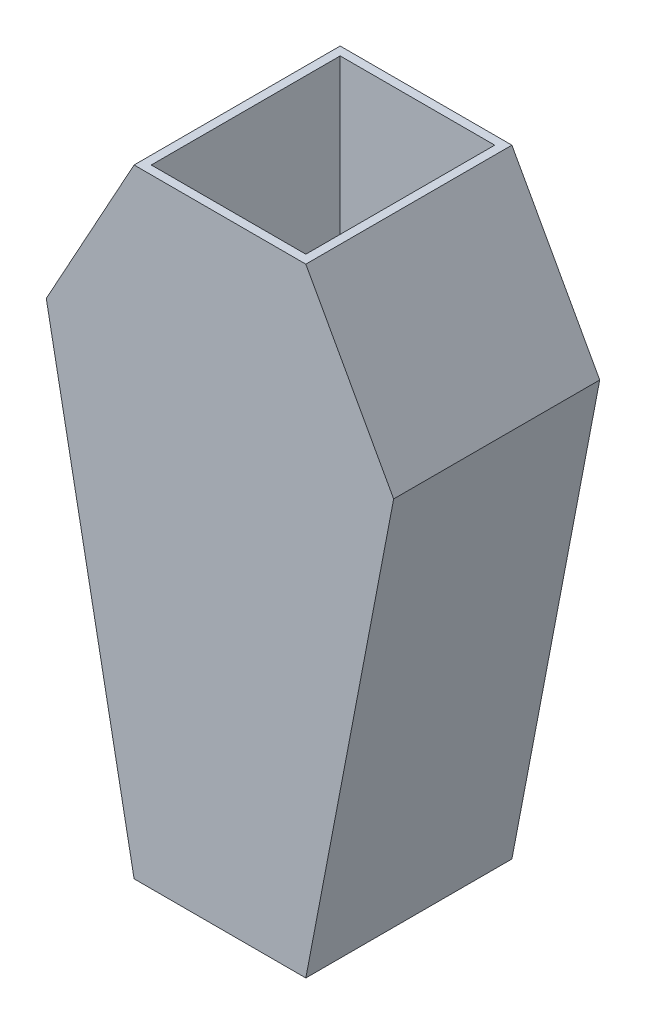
from build123d import *

# Parameters (mm, degrees)
SKETCH1_W           = 31.75
SKETCH1_H           = 228.6
BOSS_EXTRUDE1_DEPTH = 76.2
SKETCH2_W           = 57.15
SKETCH2_H           = 69.85
CUT_EXTRUDE2_DEPTH  = 215.9


with BuildPart() as part:
    # Sketch1 → Boss-Extrude1 (new body)
    with BuildSketch(Plane.XY):
        Polygon((0, 0), (0, 228.6), (-32.471279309, 169.64025), align=None)
        with Locations((15.875, 114.3)):
            Rectangle(SKETCH1_W, SKETCH1_H)
        with Locations((47.625, 114.3)):
            Rectangle(SKETCH1_W, SKETCH1_H)
        Polygon((95.971279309, 169.64025), (63.5, 0), (63.5, 228.6), align=None)
    extrude(amount=BOSS_EXTRUDE1_DEPTH)

    # Sketch2 → Cut-Extrude2 (cut)
    with BuildSketch(Plane(origin=(0, 228.6, 0), x_dir=(1, 0, 0), z_dir=(0, 1, 0))):
        with Locations((31.75, -38.1)):
            Rectangle(SKETCH2_W, SKETCH2_H)
    extrude(amount=-CUT_EXTRUDE2_DEPTH, mode=Mode.SUBTRACT)


solid = part.part
